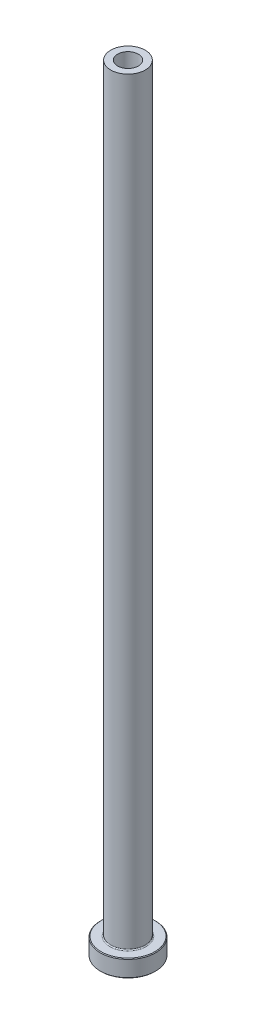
ISO-10303-21;
HEADER;
FILE_DESCRIPTION(('STEP AP214'),'2;1');
FILE_NAME('part.step','',(''),(''),'','','');
FILE_SCHEMA(('AUTOMOTIVE_DESIGN { 1 0 10303 214 1 1 1 1 }'));
ENDSEC;
DATA;
#1=APPLICATION_CONTEXT('core data for automotive mechanical design processes');
#2=APPLICATION_PROTOCOL_DEFINITION('international standard','automotive_design',2000,#1);
#3=PRODUCT_CONTEXT('',#1,'mechanical');
#4=PRODUCT('Part','Part','',(#3));
#5=PRODUCT_RELATED_PRODUCT_CATEGORY('part','',(#4));
#6=PRODUCT_DEFINITION_FORMATION('','',#4);
#7=PRODUCT_DEFINITION_CONTEXT('part definition',#1,'design');
#8=PRODUCT_DEFINITION('design','',#6,#7);
#9=PRODUCT_DEFINITION_SHAPE('','',#8);
#10=(LENGTH_UNIT() NAMED_UNIT(*) SI_UNIT(.MILLI.,.METRE.));
#11=(NAMED_UNIT(*) PLANE_ANGLE_UNIT() SI_UNIT($,.RADIAN.));
#12=(NAMED_UNIT(*) SI_UNIT($,.STERADIAN.) SOLID_ANGLE_UNIT());
#13=UNCERTAINTY_MEASURE_WITH_UNIT(LENGTH_MEASURE(1.E-05),#10,'distance_accuracy_value','');
#14=(GEOMETRIC_REPRESENTATION_CONTEXT(3) GLOBAL_UNCERTAINTY_ASSIGNED_CONTEXT((#13)) GLOBAL_UNIT_ASSIGNED_CONTEXT((#10,
#11,#12)) REPRESENTATION_CONTEXT('',''));
#15=CARTESIAN_POINT('',(0.,0.,0.));
#16=DIRECTION('',(0.,0.,1.));
#17=DIRECTION('',(1.,0.,0.));
#18=AXIS2_PLACEMENT_3D('',#15,#16,#17);
#19=CARTESIAN_POINT('',(0.,92.1876809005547,0.));
#20=DIRECTION('',(0.,1.,0.));
#21=DIRECTION('',(0.,0.,1.));
#22=AXIS2_PLACEMENT_3D('',#19,#20,#21);
#23=CYLINDRICAL_SURFACE('',#22,3.00000000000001);
#24=CARTESIAN_POINT('',(0.,225.,0.));
#25=DIRECTION('',(0.,1.,0.));
#26=DIRECTION('',(0.,0.,1.));
#27=AXIS2_PLACEMENT_3D('',#24,#25,#26);
#28=CIRCLE('',#27,3.00000000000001);
#29=CARTESIAN_POINT('',(0.,225.,3.00000000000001));
#30=VERTEX_POINT('',#29);
#31=EDGE_CURVE('E62',#30,#30,#28,.T.);
#32=ORIENTED_EDGE('',*,*,#31,.T.);
#33=EDGE_LOOP('',(#32));
#34=FACE_BOUND('',#33,.T.);
#35=CARTESIAN_POINT('',(0.,180.,0.));
#36=DIRECTION('',(0.,1.,0.));
#37=DIRECTION('',(0.,0.,1.));
#38=AXIS2_PLACEMENT_3D('',#35,#36,#37);
#39=CIRCLE('',#38,3.00000000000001);
#40=CARTESIAN_POINT('',(0.,180.,3.00000000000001));
#41=VERTEX_POINT('',#40);
#42=EDGE_CURVE('E71',#41,#41,#39,.T.);
#43=ORIENTED_EDGE('',*,*,#42,.F.);
#44=EDGE_LOOP('',(#43));
#45=FACE_BOUND('',#44,.T.);
#46=ADVANCED_FACE('F30',(#34,#45),#23,.F.);
#47=CARTESIAN_POINT('',(-3.00000000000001,225.,0.));
#48=DIRECTION('',(0.,1.,0.));
#49=DIRECTION('',(0.,0.,1.));
#50=AXIS2_PLACEMENT_3D('',#47,#48,#49);
#51=PLANE('',#50);
#52=CARTESIAN_POINT('',(0.,225.,0.));
#53=DIRECTION('',(0.,1.,0.));
#54=DIRECTION('',(0.,0.,1.));
#55=AXIS2_PLACEMENT_3D('',#52,#53,#54);
#56=CIRCLE('',#55,5.00000000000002);
#57=CARTESIAN_POINT('',(0.,225.,5.00000000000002));
#58=VERTEX_POINT('',#57);
#59=EDGE_CURVE('E65',#58,#58,#56,.T.);
#60=ORIENTED_EDGE('',*,*,#59,.T.);
#61=EDGE_LOOP('',(#60));
#62=FACE_BOUND('',#61,.T.);
#63=ORIENTED_EDGE('',*,*,#31,.F.);
#64=EDGE_LOOP('',(#63));
#65=FACE_BOUND('',#64,.T.);
#66=ADVANCED_FACE('F79',(#62,#65),#51,.T.);
#67=CARTESIAN_POINT('',(0.,92.1876809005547,0.));
#68=DIRECTION('',(0.,1.,0.));
#69=DIRECTION('',(0.,0.,1.));
#70=AXIS2_PLACEMENT_3D('',#67,#68,#69);
#71=CYLINDRICAL_SURFACE('',#70,5.);
#72=CARTESIAN_POINT('',(0.,5.3,0.));
#73=DIRECTION('',(0.,1.,0.));
#74=DIRECTION('',(0.,0.,1.));
#75=AXIS2_PLACEMENT_3D('',#72,#73,#74);
#76=CIRCLE('',#75,5.);
#77=CARTESIAN_POINT('',(0.,5.3,5.));
#78=VERTEX_POINT('',#77);
#79=EDGE_CURVE('E59',#78,#78,#76,.T.);
#80=ORIENTED_EDGE('',*,*,#79,.T.);
#81=EDGE_LOOP('',(#80));
#82=FACE_BOUND('',#81,.T.);
#83=ORIENTED_EDGE('',*,*,#59,.F.);
#84=EDGE_LOOP('',(#83));
#85=FACE_BOUND('',#84,.T.);
#86=ADVANCED_FACE('F85',(#82,#85),#71,.T.);
#87=CARTESIAN_POINT('',(-4.99999999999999,5.,0.));
#88=DIRECTION('',(0.,1.,0.));
#89=DIRECTION('',(0.,0.,1.));
#90=AXIS2_PLACEMENT_3D('',#87,#88,#89);
#91=PLANE('',#90);
#92=CARTESIAN_POINT('',(0.,5.,0.));
#93=DIRECTION('',(0.,1.,0.));
#94=DIRECTION('',(0.,0.,1.));
#95=AXIS2_PLACEMENT_3D('',#92,#93,#94);
#96=CIRCLE('',#95,7.80000000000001);
#97=CARTESIAN_POINT('',(0.,5.,7.80000000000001));
#98=VERTEX_POINT('',#97);
#99=EDGE_CURVE('E53',#98,#98,#96,.T.);
#100=ORIENTED_EDGE('',*,*,#99,.T.);
#101=EDGE_LOOP('',(#100));
#102=FACE_BOUND('',#101,.T.);
#103=CARTESIAN_POINT('',(0.,5.,0.));
#104=DIRECTION('',(0.,1.,0.));
#105=DIRECTION('',(0.,0.,1.));
#106=AXIS2_PLACEMENT_3D('',#103,#104,#105);
#107=CIRCLE('',#106,5.3);
#108=CARTESIAN_POINT('',(0.,5.,5.3));
#109=VERTEX_POINT('',#108);
#110=EDGE_CURVE('E56',#109,#109,#107,.F.);
#111=ORIENTED_EDGE('',*,*,#110,.T.);
#112=EDGE_LOOP('',(#111));
#113=FACE_BOUND('',#112,.T.);
#114=ADVANCED_FACE('F111',(#102,#113),#91,.T.);
#115=CARTESIAN_POINT('',(0.,92.1876809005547,0.));
#116=DIRECTION('',(0.,1.,0.));
#117=DIRECTION('',(0.,0.,1.));
#118=AXIS2_PLACEMENT_3D('',#115,#116,#117);
#119=CYLINDRICAL_SURFACE('',#118,7.99999999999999);
#120=CARTESIAN_POINT('',(0.,4.80000000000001,0.));
#121=DIRECTION('',(0.,1.,0.));
#122=DIRECTION('',(0.,0.,1.));
#123=AXIS2_PLACEMENT_3D('',#120,#121,#122);
#124=CIRCLE('',#123,7.99999999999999);
#125=CARTESIAN_POINT('',(0.,4.80000000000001,7.99999999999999));
#126=VERTEX_POINT('',#125);
#127=EDGE_CURVE('E45',#126,#126,#124,.F.);
#128=ORIENTED_EDGE('',*,*,#127,.T.);
#129=EDGE_LOOP('',(#128));
#130=FACE_BOUND('',#129,.T.);
#131=CARTESIAN_POINT('',(0.,0.199999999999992,0.));
#132=DIRECTION('',(0.,-1.,0.));
#133=DIRECTION('',(0.,0.,-1.));
#134=AXIS2_PLACEMENT_3D('',#131,#132,#133);
#135=CIRCLE('',#134,7.99999999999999);
#136=CARTESIAN_POINT('',(0.,0.199999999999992,-7.99999999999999));
#137=VERTEX_POINT('',#136);
#138=EDGE_CURVE('E50',#137,#137,#135,.F.);
#139=ORIENTED_EDGE('',*,*,#138,.T.);
#140=EDGE_LOOP('',(#139));
#141=FACE_BOUND('',#140,.T.);
#142=ADVANCED_FACE('F108',(#130,#141),#119,.T.);
#143=CARTESIAN_POINT('',(-7.99999999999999,0.,0.));
#144=DIRECTION('',(0.,-1.,0.));
#145=DIRECTION('',(0.,0.,-1.));
#146=AXIS2_PLACEMENT_3D('',#143,#144,#145);
#147=PLANE('',#146);
#148=CARTESIAN_POINT('',(0.,0.,0.));
#149=DIRECTION('',(0.,-1.,0.));
#150=DIRECTION('',(0.,0.,-1.));
#151=AXIS2_PLACEMENT_3D('',#148,#149,#150);
#152=CIRCLE('',#151,3.75);
#153=CARTESIAN_POINT('',(0.,0.,-3.75));
#154=VERTEX_POINT('',#153);
#155=EDGE_CURVE('E37',#154,#154,#152,.F.);
#156=ORIENTED_EDGE('',*,*,#155,.T.);
#157=EDGE_LOOP('',(#156));
#158=FACE_BOUND('',#157,.T.);
#159=CARTESIAN_POINT('',(0.,0.,0.));
#160=DIRECTION('',(0.,-1.,0.));
#161=DIRECTION('',(0.,0.,-1.));
#162=AXIS2_PLACEMENT_3D('',#159,#160,#161);
#163=CIRCLE('',#162,7.8);
#164=CARTESIAN_POINT('',(0.,0.,-7.8));
#165=VERTEX_POINT('',#164);
#166=EDGE_CURVE('E41',#165,#165,#163,.T.);
#167=ORIENTED_EDGE('',*,*,#166,.T.);
#168=EDGE_LOOP('',(#167));
#169=FACE_BOUND('',#168,.T.);
#170=ADVANCED_FACE('F110',(#158,#169),#147,.T.);
#171=CARTESIAN_POINT('',(0.,92.1876809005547,0.));
#172=DIRECTION('',(0.,1.,0.));
#173=DIRECTION('',(0.,0.,1.));
#174=AXIS2_PLACEMENT_3D('',#171,#172,#173);
#175=CYLINDRICAL_SURFACE('',#174,3.25);
#176=CARTESIAN_POINT('',(0.,0.499999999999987,0.));
#177=DIRECTION('',(0.,-1.,0.));
#178=DIRECTION('',(0.,0.,-1.));
#179=AXIS2_PLACEMENT_3D('',#176,#177,#178);
#180=CIRCLE('',#179,3.25);
#181=CARTESIAN_POINT('',(0.,0.499999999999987,-3.25));
#182=VERTEX_POINT('',#181);
#183=EDGE_CURVE('E10',#182,#182,#180,.T.);
#184=ORIENTED_EDGE('',*,*,#183,.T.);
#185=EDGE_LOOP('',(#184));
#186=FACE_BOUND('',#185,.T.);
#187=CARTESIAN_POINT('',(0.,168.,0.));
#188=DIRECTION('',(0.,1.,0.));
#189=DIRECTION('',(0.,0.,1.));
#190=AXIS2_PLACEMENT_3D('',#187,#188,#189);
#191=CIRCLE('',#190,3.25000000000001);
#192=CARTESIAN_POINT('',(0.,168.,3.25000000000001));
#193=VERTEX_POINT('',#192);
#194=EDGE_CURVE('E68',#193,#193,#191,.T.);
#195=ORIENTED_EDGE('',*,*,#194,.T.);
#196=EDGE_LOOP('',(#195));
#197=FACE_BOUND('',#196,.T.);
#198=ADVANCED_FACE('F118',(#186,#197),#175,.F.);
#199=CARTESIAN_POINT('',(0.,168.,0.));
#200=DIRECTION('',(0.,-1.,0.));
#201=DIRECTION('',(0.,0.,-1.));
#202=AXIS2_PLACEMENT_3D('',#199,#200,#201);
#203=CONICAL_SURFACE('',#202,3.25000000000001,0.0208303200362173);
#204=ORIENTED_EDGE('',*,*,#42,.T.);
#205=EDGE_LOOP('',(#204));
#206=FACE_BOUND('',#205,.T.);
#207=ORIENTED_EDGE('',*,*,#194,.F.);
#208=EDGE_LOOP('',(#207));
#209=FACE_BOUND('',#208,.T.);
#210=ADVANCED_FACE('F75',(#206,#209),#203,.F.);
#211=CARTESIAN_POINT('',(0.,5.3,0.));
#212=DIRECTION('',(0.,1.,0.));
#213=DIRECTION('',(0.,0.,1.));
#214=AXIS2_PLACEMENT_3D('',#211,#212,#213);
#215=TOROIDAL_SURFACE('',#214,5.3,0.3);
#216=ORIENTED_EDGE('',*,*,#110,.F.);
#217=EDGE_LOOP('',(#216));
#218=FACE_BOUND('',#217,.T.);
#219=ORIENTED_EDGE('',*,*,#79,.F.);
#220=EDGE_LOOP('',(#219));
#221=FACE_BOUND('',#220,.T.);
#222=ADVANCED_FACE('F90',(#218,#221),#215,.F.);
#223=CARTESIAN_POINT('',(0.,5.,0.));
#224=DIRECTION('',(0.,-1.,0.));
#225=DIRECTION('',(0.,0.,-1.));
#226=AXIS2_PLACEMENT_3D('',#223,#224,#225);
#227=CONICAL_SURFACE('',#226,7.8,0.78539816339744);
#228=ORIENTED_EDGE('',*,*,#127,.F.);
#229=EDGE_LOOP('',(#228));
#230=FACE_BOUND('',#229,.T.);
#231=ORIENTED_EDGE('',*,*,#99,.F.);
#232=EDGE_LOOP('',(#231));
#233=FACE_BOUND('',#232,.T.);
#234=ADVANCED_FACE('F93',(#230,#233),#227,.T.);
#235=CARTESIAN_POINT('',(0.,0.199999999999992,0.));
#236=DIRECTION('',(0.,1.,0.));
#237=DIRECTION('',(0.,0.,1.));
#238=AXIS2_PLACEMENT_3D('',#235,#236,#237);
#239=CONICAL_SURFACE('',#238,7.99999999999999,0.78539816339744);
#240=ORIENTED_EDGE('',*,*,#166,.F.);
#241=EDGE_LOOP('',(#240));
#242=FACE_BOUND('',#241,.T.);
#243=ORIENTED_EDGE('',*,*,#138,.F.);
#244=EDGE_LOOP('',(#243));
#245=FACE_BOUND('',#244,.T.);
#246=ADVANCED_FACE('F96',(#242,#245),#239,.T.);
#247=CARTESIAN_POINT('',(0.,0.,0.));
#248=DIRECTION('',(0.,-1.,0.));
#249=DIRECTION('',(0.,0.,-1.));
#250=AXIS2_PLACEMENT_3D('',#247,#248,#249);
#251=CONICAL_SURFACE('',#250,3.75,0.785398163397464);
#252=ORIENTED_EDGE('',*,*,#183,.F.);
#253=EDGE_LOOP('',(#252));
#254=FACE_BOUND('',#253,.T.);
#255=ORIENTED_EDGE('',*,*,#155,.F.);
#256=EDGE_LOOP('',(#255));
#257=FACE_BOUND('',#256,.T.);
#258=ADVANCED_FACE('F32',(#254,#257),#251,.F.);
#259=CLOSED_SHELL('',(#46,#66,#86,#114,#142,#170,#198,#210,#222,#234,#246,#258));
#260=MANIFOLD_SOLID_BREP('B2',#259);
#261=ADVANCED_BREP_SHAPE_REPRESENTATION('',(#18,#260),#14);
#262=SHAPE_DEFINITION_REPRESENTATION(#9,#261);
ENDSEC;
END-ISO-10303-21;
